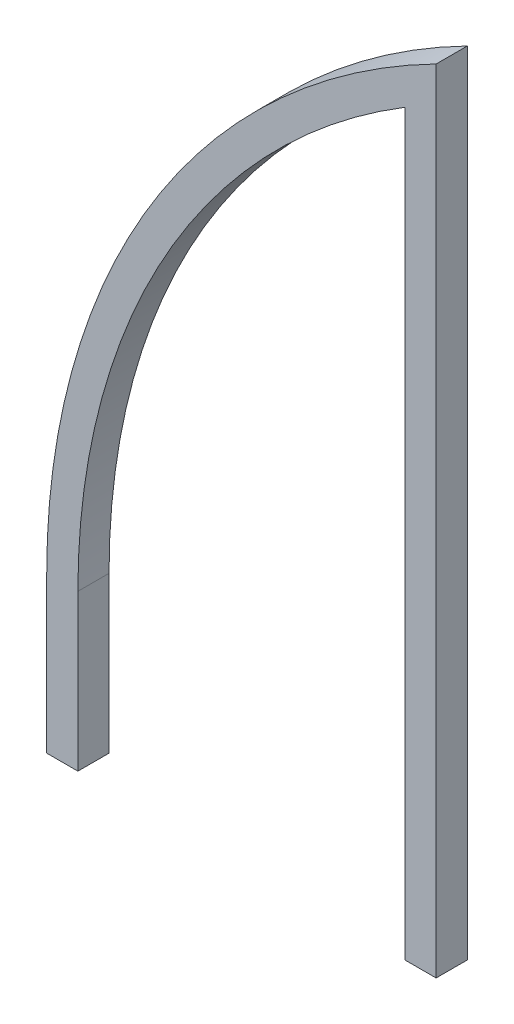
ISO-10303-21;
HEADER;
FILE_DESCRIPTION(('STEP AP214'),'2;1');
FILE_NAME('part.step','',(''),(''),'','','');
FILE_SCHEMA(('AUTOMOTIVE_DESIGN { 1 0 10303 214 1 1 1 1 }'));
ENDSEC;
DATA;
#1=APPLICATION_CONTEXT('core data for automotive mechanical design processes');
#2=APPLICATION_PROTOCOL_DEFINITION('international standard','automotive_design',2000,#1);
#3=PRODUCT_CONTEXT('',#1,'mechanical');
#4=PRODUCT('Part','Part','',(#3));
#5=PRODUCT_RELATED_PRODUCT_CATEGORY('part','',(#4));
#6=PRODUCT_DEFINITION_FORMATION('','',#4);
#7=PRODUCT_DEFINITION_CONTEXT('part definition',#1,'design');
#8=PRODUCT_DEFINITION('design','',#6,#7);
#9=PRODUCT_DEFINITION_SHAPE('','',#8);
#10=(LENGTH_UNIT() NAMED_UNIT(*) SI_UNIT(.MILLI.,.METRE.));
#11=(NAMED_UNIT(*) PLANE_ANGLE_UNIT() SI_UNIT($,.RADIAN.));
#12=(NAMED_UNIT(*) SI_UNIT($,.STERADIAN.) SOLID_ANGLE_UNIT());
#13=UNCERTAINTY_MEASURE_WITH_UNIT(LENGTH_MEASURE(1.E-05),#10,'distance_accuracy_value','');
#14=(GEOMETRIC_REPRESENTATION_CONTEXT(3) GLOBAL_UNCERTAINTY_ASSIGNED_CONTEXT((#13)) GLOBAL_UNIT_ASSIGNED_CONTEXT((#10,
#11,#12)) REPRESENTATION_CONTEXT('',''));
#15=CARTESIAN_POINT('',(0.,0.,0.));
#16=DIRECTION('',(0.,0.,1.));
#17=DIRECTION('',(1.,0.,0.));
#18=AXIS2_PLACEMENT_3D('',#15,#16,#17);
#19=CARTESIAN_POINT('',(-1481.70140438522,-491.370616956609,80.));
#20=DIRECTION('',(1.,0.,0.));
#21=DIRECTION('',(0.,0.,-1.));
#22=AXIS2_PLACEMENT_3D('',#19,#20,#21);
#23=PLANE('',#22);
#24=DIRECTION('',(0.,-1.,0.));
#25=VECTOR('',#24,1.);
#26=CARTESIAN_POINT('',(-1481.70140438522,-491.370616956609,0.));
#27=LINE('',#26,#25);
#28=CARTESIAN_POINT('',(-1481.70140438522,-91.3706169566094,0.));
#29=VERTEX_POINT('',#28);
#30=CARTESIAN_POINT('',(-1481.70140438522,-491.370616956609,0.));
#31=VERTEX_POINT('',#30);
#32=EDGE_CURVE('E128',#29,#31,#27,.T.);
#33=ORIENTED_EDGE('',*,*,#32,.T.);
#34=DIRECTION('',(0.,0.,-1.));
#35=VECTOR('',#34,1.);
#36=CARTESIAN_POINT('',(-1481.70140438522,-491.370616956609,80.));
#37=LINE('',#36,#35);
#38=CARTESIAN_POINT('',(-1481.70140438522,-491.370616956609,80.));
#39=VERTEX_POINT('',#38);
#40=EDGE_CURVE('E11',#39,#31,#37,.T.);
#41=ORIENTED_EDGE('',*,*,#40,.F.);
#42=DIRECTION('',(0.,-1.,0.));
#43=VECTOR('',#42,1.);
#44=CARTESIAN_POINT('',(-1481.70140438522,-491.370616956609,80.));
#45=LINE('',#44,#43);
#46=CARTESIAN_POINT('',(-1481.70140438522,-91.3706169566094,80.));
#47=VERTEX_POINT('',#46);
#48=EDGE_CURVE('E142',#47,#39,#45,.T.);
#49=ORIENTED_EDGE('',*,*,#48,.F.);
#50=DIRECTION('',(0.,0.,-1.));
#51=VECTOR('',#50,1.);
#52=CARTESIAN_POINT('',(-1481.70140438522,-91.3706169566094,80.));
#53=LINE('',#52,#51);
#54=EDGE_CURVE('E124',#47,#29,#53,.T.);
#55=ORIENTED_EDGE('',*,*,#54,.T.);
#56=EDGE_LOOP('',(#33,#41,#49,#55));
#57=FACE_BOUND('',#56,.T.);
#58=ADVANCED_FACE('F32',(#57),#23,.F.);
#59=CARTESIAN_POINT('',(-1481.70140438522,-491.370616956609,80.));
#60=DIRECTION('',(0.,1.,0.));
#61=DIRECTION('',(0.,0.,1.));
#62=AXIS2_PLACEMENT_3D('',#59,#60,#61);
#63=PLANE('',#62);
#64=DIRECTION('',(1.,0.,0.));
#65=VECTOR('',#64,1.);
#66=CARTESIAN_POINT('',(-1481.70140438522,-491.370616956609,0.));
#67=LINE('',#66,#65);
#68=CARTESIAN_POINT('',(-1401.70140438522,-491.370616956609,0.));
#69=VERTEX_POINT('',#68);
#70=EDGE_CURVE('E131',#31,#69,#67,.T.);
#71=ORIENTED_EDGE('',*,*,#70,.T.);
#72=DIRECTION('',(0.,0.,-1.));
#73=VECTOR('',#72,1.);
#74=CARTESIAN_POINT('',(-1401.70140438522,-491.370616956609,80.));
#75=LINE('',#74,#73);
#76=CARTESIAN_POINT('',(-1401.70140438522,-491.370616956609,80.));
#77=VERTEX_POINT('',#76);
#78=EDGE_CURVE('E40',#77,#69,#75,.T.);
#79=ORIENTED_EDGE('',*,*,#78,.F.);
#80=DIRECTION('',(1.,0.,0.));
#81=VECTOR('',#80,1.);
#82=CARTESIAN_POINT('',(-1481.70140438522,-491.370616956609,80.));
#83=LINE('',#82,#81);
#84=EDGE_CURVE('E91',#39,#77,#83,.T.);
#85=ORIENTED_EDGE('',*,*,#84,.F.);
#86=ORIENTED_EDGE('',*,*,#40,.T.);
#87=EDGE_LOOP('',(#71,#79,#85,#86));
#88=FACE_BOUND('',#87,.T.);
#89=ADVANCED_FACE('F177',(#88),#63,.F.);
#90=CARTESIAN_POINT('',(-1401.70140438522,-491.370616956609,80.));
#91=DIRECTION('',(-1.,0.,0.));
#92=DIRECTION('',(0.,0.,1.));
#93=AXIS2_PLACEMENT_3D('',#90,#91,#92);
#94=PLANE('',#93);
#95=DIRECTION('',(0.,1.,0.));
#96=VECTOR('',#95,1.);
#97=CARTESIAN_POINT('',(-1401.70140438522,-491.370616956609,0.));
#98=LINE('',#97,#96);
#99=CARTESIAN_POINT('',(-1401.70140438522,-91.3706169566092,0.));
#100=VERTEX_POINT('',#99);
#101=EDGE_CURVE('E133',#69,#100,#98,.T.);
#102=ORIENTED_EDGE('',*,*,#101,.T.);
#103=DIRECTION('',(0.,0.,-1.));
#104=VECTOR('',#103,1.);
#105=CARTESIAN_POINT('',(-1401.70140438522,-91.3706169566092,80.));
#106=LINE('',#105,#104);
#107=CARTESIAN_POINT('',(-1401.70140438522,-91.3706169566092,80.));
#108=VERTEX_POINT('',#107);
#109=EDGE_CURVE('E149',#108,#100,#106,.T.);
#110=ORIENTED_EDGE('',*,*,#109,.F.);
#111=DIRECTION('',(0.,1.,0.));
#112=VECTOR('',#111,1.);
#113=CARTESIAN_POINT('',(-1401.70140438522,-491.370616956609,80.));
#114=LINE('',#113,#112);
#115=EDGE_CURVE('E157',#77,#108,#114,.T.);
#116=ORIENTED_EDGE('',*,*,#115,.F.);
#117=ORIENTED_EDGE('',*,*,#78,.T.);
#118=EDGE_LOOP('',(#102,#110,#116,#117));
#119=FACE_BOUND('',#118,.T.);
#120=ADVANCED_FACE('F155',(#119),#94,.F.);
#121=CARTESIAN_POINT('',(351.335117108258,-91.3706169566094,80.));
#122=DIRECTION('',(0.,0.,-1.));
#123=DIRECTION('',(-1.,0.,0.));
#124=AXIS2_PLACEMENT_3D('',#121,#122,#123);
#125=CYLINDRICAL_SURFACE('',#124,1753.03652149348);
#126=CARTESIAN_POINT('',(351.335117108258,-91.3706169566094,0.));
#127=DIRECTION('',(0.,0.,-1.));
#128=DIRECTION('',(-1.,0.,0.));
#129=AXIS2_PLACEMENT_3D('',#126,#127,#128);
#130=CIRCLE('',#129,1753.03652149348);
#131=CARTESIAN_POINT('',(-561.70140438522,1405.12574324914,0.));
#132=VERTEX_POINT('',#131);
#133=EDGE_CURVE('E135',#100,#132,#130,.T.);
#134=ORIENTED_EDGE('',*,*,#133,.T.);
#135=DIRECTION('',(0.,0.,-1.));
#136=VECTOR('',#135,1.);
#137=CARTESIAN_POINT('',(-561.70140438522,1405.12574324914,80.));
#138=LINE('',#137,#136);
#139=CARTESIAN_POINT('',(-561.70140438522,1405.12574324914,80.));
#140=VERTEX_POINT('',#139);
#141=EDGE_CURVE('E146',#140,#132,#138,.T.);
#142=ORIENTED_EDGE('',*,*,#141,.F.);
#143=CARTESIAN_POINT('',(351.335117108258,-91.3706169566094,80.));
#144=DIRECTION('',(0.,0.,-1.));
#145=DIRECTION('',(-1.,0.,0.));
#146=AXIS2_PLACEMENT_3D('',#143,#144,#145);
#147=CIRCLE('',#146,1753.03652149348);
#148=EDGE_CURVE('E169',#108,#140,#147,.T.);
#149=ORIENTED_EDGE('',*,*,#148,.F.);
#150=ORIENTED_EDGE('',*,*,#109,.T.);
#151=EDGE_LOOP('',(#134,#142,#149,#150));
#152=FACE_BOUND('',#151,.T.);
#153=ADVANCED_FACE('F165',(#152),#125,.F.);
#154=CARTESIAN_POINT('',(-561.70140438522,-491.370616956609,80.));
#155=DIRECTION('',(1.,0.,0.));
#156=DIRECTION('',(0.,0.,-1.));
#157=AXIS2_PLACEMENT_3D('',#154,#155,#156);
#158=PLANE('',#157);
#159=DIRECTION('',(0.,-1.,0.));
#160=VECTOR('',#159,1.);
#161=CARTESIAN_POINT('',(-561.70140438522,-491.370616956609,0.));
#162=LINE('',#161,#160);
#163=CARTESIAN_POINT('',(-561.70140438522,-491.370616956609,0.));
#164=VERTEX_POINT('',#163);
#165=EDGE_CURVE('E137',#132,#164,#162,.T.);
#166=ORIENTED_EDGE('',*,*,#165,.T.);
#167=DIRECTION('',(0.,0.,-1.));
#168=VECTOR('',#167,1.);
#169=CARTESIAN_POINT('',(-561.70140438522,-491.370616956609,80.));
#170=LINE('',#169,#168);
#171=CARTESIAN_POINT('',(-561.70140438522,-491.370616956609,80.));
#172=VERTEX_POINT('',#171);
#173=EDGE_CURVE('E119',#172,#164,#170,.T.);
#174=ORIENTED_EDGE('',*,*,#173,.F.);
#175=DIRECTION('',(0.,-1.,0.));
#176=VECTOR('',#175,1.);
#177=CARTESIAN_POINT('',(-561.70140438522,-491.370616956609,80.));
#178=LINE('',#177,#176);
#179=EDGE_CURVE('E110',#140,#172,#178,.T.);
#180=ORIENTED_EDGE('',*,*,#179,.F.);
#181=ORIENTED_EDGE('',*,*,#141,.T.);
#182=EDGE_LOOP('',(#166,#174,#180,#181));
#183=FACE_BOUND('',#182,.T.);
#184=ADVANCED_FACE('F168',(#183),#158,.F.);
#185=CARTESIAN_POINT('',(-561.70140438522,-491.370616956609,80.));
#186=DIRECTION('',(0.,1.,0.));
#187=DIRECTION('',(0.,0.,1.));
#188=AXIS2_PLACEMENT_3D('',#185,#186,#187);
#189=PLANE('',#188);
#190=DIRECTION('',(1.,0.,0.));
#191=VECTOR('',#190,1.);
#192=CARTESIAN_POINT('',(-561.70140438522,-491.370616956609,0.));
#193=LINE('',#192,#191);
#194=CARTESIAN_POINT('',(-481.701404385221,-491.370616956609,0.));
#195=VERTEX_POINT('',#194);
#196=EDGE_CURVE('E118',#164,#195,#193,.T.);
#197=ORIENTED_EDGE('',*,*,#196,.T.);
#198=DIRECTION('',(0.,0.,-1.));
#199=VECTOR('',#198,1.);
#200=CARTESIAN_POINT('',(-481.701404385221,-491.370616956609,80.));
#201=LINE('',#200,#199);
#202=CARTESIAN_POINT('',(-481.701404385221,-491.370616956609,80.));
#203=VERTEX_POINT('',#202);
#204=EDGE_CURVE('E115',#203,#195,#201,.T.);
#205=ORIENTED_EDGE('',*,*,#204,.F.);
#206=DIRECTION('',(1.,0.,0.));
#207=VECTOR('',#206,1.);
#208=CARTESIAN_POINT('',(-561.70140438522,-491.370616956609,80.));
#209=LINE('',#208,#207);
#210=EDGE_CURVE('E104',#172,#203,#209,.T.);
#211=ORIENTED_EDGE('',*,*,#210,.F.);
#212=ORIENTED_EDGE('',*,*,#173,.T.);
#213=EDGE_LOOP('',(#197,#205,#211,#212));
#214=FACE_BOUND('',#213,.T.);
#215=ADVANCED_FACE('F116',(#214),#189,.F.);
#216=CARTESIAN_POINT('',(-481.701404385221,-491.370616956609,80.));
#217=DIRECTION('',(-1.,0.,0.));
#218=DIRECTION('',(0.,-1.,0.));
#219=AXIS2_PLACEMENT_3D('',#216,#217,#218);
#220=PLANE('',#219);
#221=DIRECTION('',(0.,1.,0.));
#222=VECTOR('',#221,1.);
#223=CARTESIAN_POINT('',(-481.701404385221,-491.370616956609,0.));
#224=LINE('',#223,#222);
#225=CARTESIAN_POINT('',(-481.70140438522,1541.44077539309,0.));
#226=VERTEX_POINT('',#225);
#227=EDGE_CURVE('E77',#195,#226,#224,.T.);
#228=ORIENTED_EDGE('',*,*,#227,.T.);
#229=DIRECTION('',(0.,0.,-1.));
#230=VECTOR('',#229,1.);
#231=CARTESIAN_POINT('',(-481.70140438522,1541.44077539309,80.));
#232=LINE('',#231,#230);
#233=CARTESIAN_POINT('',(-481.70140438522,1541.44077539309,80.));
#234=VERTEX_POINT('',#233);
#235=EDGE_CURVE('E120',#234,#226,#232,.T.);
#236=ORIENTED_EDGE('',*,*,#235,.F.);
#237=DIRECTION('',(0.,1.,0.));
#238=VECTOR('',#237,1.);
#239=CARTESIAN_POINT('',(-481.701404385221,-491.370616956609,80.));
#240=LINE('',#239,#238);
#241=EDGE_CURVE('E108',#203,#234,#240,.T.);
#242=ORIENTED_EDGE('',*,*,#241,.F.);
#243=ORIENTED_EDGE('',*,*,#204,.T.);
#244=EDGE_LOOP('',(#228,#236,#242,#243));
#245=FACE_BOUND('',#244,.T.);
#246=ADVANCED_FACE('F122',(#245),#220,.F.);
#247=CARTESIAN_POINT('',(351.335117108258,-91.3706169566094,80.));
#248=DIRECTION('',(0.,0.,-1.));
#249=DIRECTION('',(-1.,0.,0.));
#250=AXIS2_PLACEMENT_3D('',#247,#248,#249);
#251=CYLINDRICAL_SURFACE('',#250,1833.03652149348);
#252=CARTESIAN_POINT('',(351.335117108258,-91.3706169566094,0.));
#253=DIRECTION('',(0.,0.,1.));
#254=DIRECTION('',(-1.,0.,0.));
#255=AXIS2_PLACEMENT_3D('',#252,#253,#254);
#256=CIRCLE('',#255,1833.03652149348);
#257=EDGE_CURVE('E83',#226,#29,#256,.T.);
#258=ORIENTED_EDGE('',*,*,#257,.T.);
#259=ORIENTED_EDGE('',*,*,#54,.F.);
#260=CARTESIAN_POINT('',(351.335117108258,-91.3706169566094,80.));
#261=DIRECTION('',(0.,0.,1.));
#262=DIRECTION('',(-1.,0.,0.));
#263=AXIS2_PLACEMENT_3D('',#260,#261,#262);
#264=CIRCLE('',#263,1833.03652149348);
#265=EDGE_CURVE('E48',#234,#47,#264,.T.);
#266=ORIENTED_EDGE('',*,*,#265,.F.);
#267=ORIENTED_EDGE('',*,*,#235,.T.);
#268=EDGE_LOOP('',(#258,#259,#266,#267));
#269=FACE_BOUND('',#268,.T.);
#270=ADVANCED_FACE('F193',(#269),#251,.T.);
#271=CARTESIAN_POINT('',(351.335117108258,-91.3706169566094,80.));
#272=DIRECTION('',(0.,0.,-1.));
#273=DIRECTION('',(-1.,0.,0.));
#274=AXIS2_PLACEMENT_3D('',#271,#272,#273);
#275=PLANE('',#274);
#276=ORIENTED_EDGE('',*,*,#48,.T.);
#277=ORIENTED_EDGE('',*,*,#84,.T.);
#278=ORIENTED_EDGE('',*,*,#115,.T.);
#279=ORIENTED_EDGE('',*,*,#148,.T.);
#280=ORIENTED_EDGE('',*,*,#179,.T.);
#281=ORIENTED_EDGE('',*,*,#210,.T.);
#282=ORIENTED_EDGE('',*,*,#241,.T.);
#283=ORIENTED_EDGE('',*,*,#265,.T.);
#284=EDGE_LOOP('',(#276,#277,#278,#279,#280,#281,#282,#283));
#285=FACE_BOUND('',#284,.T.);
#286=ADVANCED_FACE('F106',(#285),#275,.F.);
#287=CARTESIAN_POINT('',(351.335117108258,-91.3706169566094,0.));
#288=DIRECTION('',(0.,0.,-1.));
#289=DIRECTION('',(-1.,0.,0.));
#290=AXIS2_PLACEMENT_3D('',#287,#288,#289);
#291=PLANE('',#290);
#292=ORIENTED_EDGE('',*,*,#32,.F.);
#293=ORIENTED_EDGE('',*,*,#257,.F.);
#294=ORIENTED_EDGE('',*,*,#227,.F.);
#295=ORIENTED_EDGE('',*,*,#196,.F.);
#296=ORIENTED_EDGE('',*,*,#165,.F.);
#297=ORIENTED_EDGE('',*,*,#133,.F.);
#298=ORIENTED_EDGE('',*,*,#101,.F.);
#299=ORIENTED_EDGE('',*,*,#70,.F.);
#300=EDGE_LOOP('',(#292,#293,#294,#295,#296,#297,#298,#299));
#301=FACE_BOUND('',#300,.T.);
#302=ADVANCED_FACE('F161',(#301),#291,.T.);
#303=CLOSED_SHELL('',(#58,#89,#120,#153,#184,#215,#246,#270,#286,#302));
#304=MANIFOLD_SOLID_BREP('B2',#303);
#305=ADVANCED_BREP_SHAPE_REPRESENTATION('',(#18,#304),#14);
#306=SHAPE_DEFINITION_REPRESENTATION(#9,#305);
ENDSEC;
END-ISO-10303-21;
